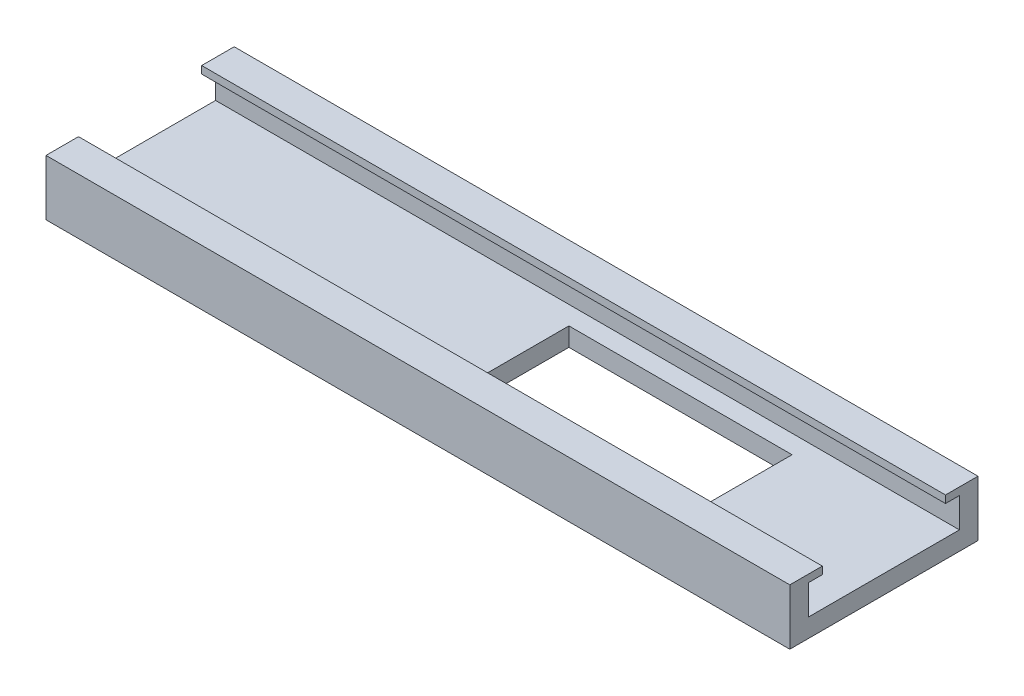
from build123d import *

# Parameters (mm, degrees)
BOSS_EXTRUDE1_DEPTH = 254
SKETCH3_W           = 76.2
SKETCH3_H           = 38.1
CUT_EXTRUDE1_DEPTH  = 263.310683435


with BuildPart() as part:
    # Sketch2 → Boss-Extrude1 (new body)
    with BuildSketch(Plane(origin=(0, 0, 0), x_dir=(0, 0, -1), z_dir=(1, 0, 0))):
        Polygon((0, 0), (64.262, 0), (64.262, 19.05), (53.1622, 19.05), (53.1622, 16.51), (57.912, 16.51), (57.912, 6.35), (6.35, 6.35), (6.35, 16.51), (11.0998, 16.51), (11.0998, 19.05), (0, 19.05), align=None)
    extrude(amount=BOSS_EXTRUDE1_DEPTH)

    # Sketch3 → Cut-Extrude1 (cut, through all)
    with BuildSketch(Plane(origin=(0, 6.35, 0), x_dir=(1, 0, 0), z_dir=(0, 1, 0))):
        with Locations((165.1, 32.512)):
            Rectangle(SKETCH3_W, SKETCH3_H)
    extrude(amount=-CUT_EXTRUDE1_DEPTH, mode=Mode.SUBTRACT)


solid = part.part
